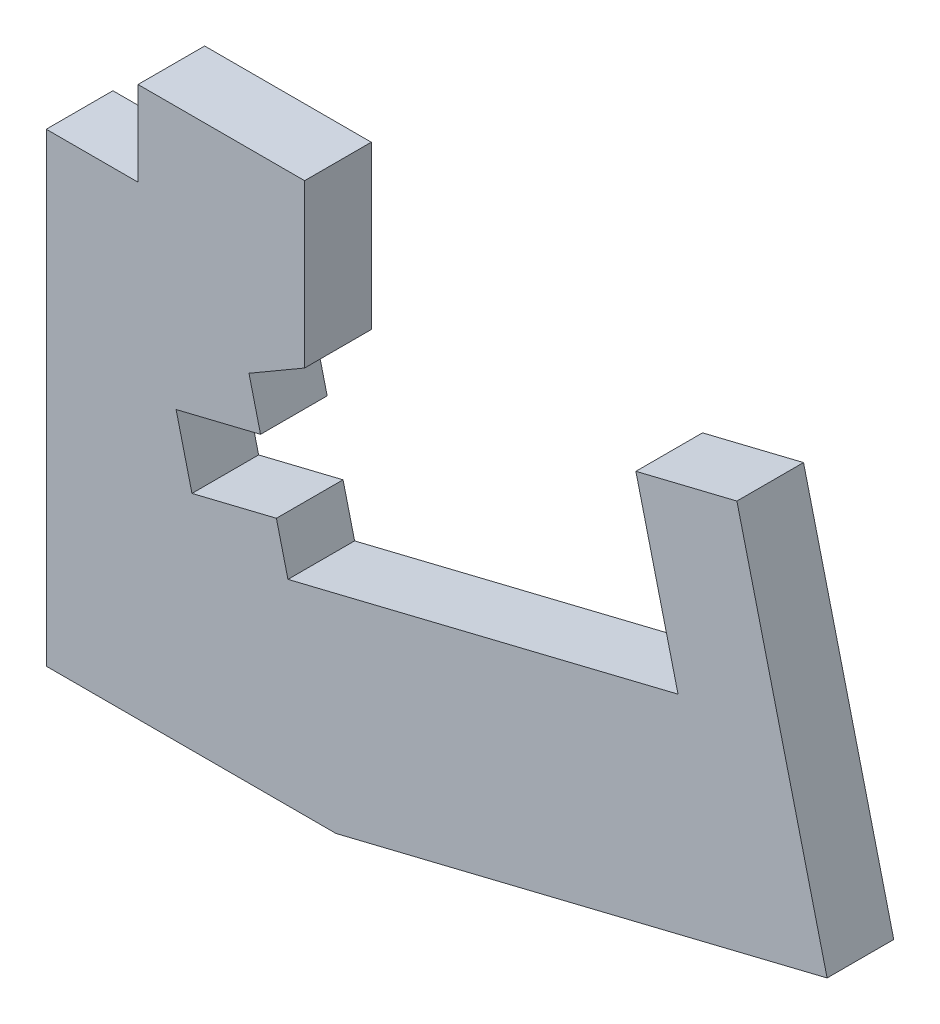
from build123d import *

# Parameters (mm, degrees)
EXTRUDE1_DEPTH = 5.842


with BuildPart() as part:
    # Sketch1 → Extrude1 (new body)
    with BuildSketch(Plane.XY):
        Polygon((0, 40.764501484), (0, 0), (25.4, 0), (68.446907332, 10.553420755), (60.539381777, 42.807845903), (51.684334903, 40.636934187), (55.37875567, 25.567565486), (21.186895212, 17.185056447), (20.173857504, 21.317189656), (12.773021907, 19.50279376), (11.381985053, 25.176767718), (18.78282065, 26.991163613), (17.769782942, 31.123296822), (22.647929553, 33.959597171), (22.647929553, 48.182004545), (8.043801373, 48.182004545), (8.043801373, 40.764501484), align=None)
    extrude(amount=EXTRUDE1_DEPTH)


solid = part.part
